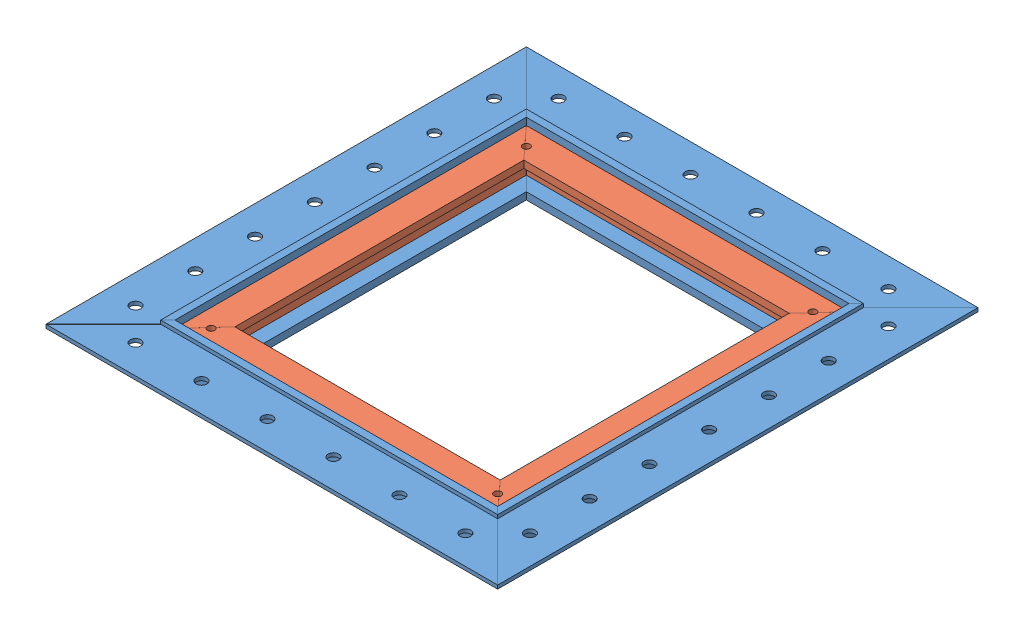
SolidWorks assembly 611 - Copy.SLDASM, configuration Default (file format 11000). Lengths in mm.
Overall size (200.03 22.23 212.72).
16 component instances, 5 part files, 32 mates.
Components (placement in the parent):
- J-Frame AG10 Grille(For aluminium)-2: J-Frame AG10 Grille(For aluminium).SLDPRT [Default] at origin size (200.03 22.23 212.72)
- 208 Lattice Perforated Grille(3_8)-1: 208 Lattice Perforated Grille(3_8).SLDPRT [Default] at (61.9125 22.225 0) x (0 0 -1) z (0 -1 0) (suppressed, hidden)
- Screw-1: Screw.SLDPRT [Default] at (125.349 19.05 -69.7865) x (0 1 0) z (1 0 0) (suppressed, hidden)
- Screw-2: Screw.SLDPRT [Default] at (-1.524 19.05 -69.7865) x (0 1 0) z (1 0 0) (suppressed, hidden)
- Screw-3: Screw.SLDPRT [Default] at (125.349 19.05 69.7865) x (0 1 0) z (-1 0 0) (suppressed, hidden)
- Screw-4: Screw.SLDPRT [Default] at (-1.524 19.05 69.7865) x (0 1 0) z (-1 0 0) (suppressed, hidden)
- Typical Dry Wall Screw-1: Typical Dry Wall Screw.SLDPRT [Default] at (-25.4 20.6375 -79.375) (suppressed, hidden)
- Typical Dry Wall Screw-2: Typical Dry Wall Screw.SLDPRT [Default] at (-25.4 20.6375 52.9167) (suppressed, hidden)
- Typical Dry Wall Screw-3: Typical Dry Wall Screw.SLDPRT [Default] at (-11.1125 20.6375 93.6625) (suppressed, hidden)
- Typical Dry Wall Screw-4: Typical Dry Wall Screw.SLDPRT [Default] at (105.7275 20.6375 93.6625) (suppressed, hidden)
- Typical Dry Wall Screw-5: Typical Dry Wall Screw.SLDPRT [Default] at (149.225 20.6375 79.375) (suppressed, hidden)
- Typical Dry Wall Screw-6: Typical Dry Wall Screw.SLDPRT [Default] at (149.225 20.6375 -52.9167) (suppressed, hidden)
- Typical Dry Wall Screw-7: Typical Dry Wall Screw.SLDPRT [Default] at (134.9375 20.6375 -93.6625) (suppressed, hidden)
- Typical Dry Wall Screw-8: Typical Dry Wall Screw.SLDPRT [Default] at (18.0975 20.6375 -93.6625) (suppressed, hidden)
- Angle-1: Angle.SLDPRT [Default] at (61.9125 19.05 0) size (142.88 15.88 155.57)
- Angle-2: Angle.SLDPRT [Default] at (61.9125 19.05 0) x (-1 0 0) z (0 0 -1) size (142.88 15.88 155.57) (suppressed, hidden)
Mates (geometry in assembly coordinates):
- Coincident1: coincident: plane of assembly; plane of assembly; plane of J-Frame AG10 Grille(For aluminium)-2 through (0 22.225 77.7875) normal (0 1 0); plane of 208 Lattice Perforated Grille(3_8)-1 through (61.9125 22.225 0) normal (0 1 0)
- Distance1: distance = 1.5875 mm: plane of assembly; plane of assembly; plane of 208 Lattice Perforated Grille(3_8)-1 through (131.7625 19.05 -76.2) normal (0 0 -1); plane of J-Frame AG10 Grille(For aluminium)-2 through (-38.1 0 -77.7875) normal (0 0 1)
- Distance2: distance = 1.5875 mm: plane of assembly; plane of assembly; plane of 208 Lattice Perforated Grille(3_8)-1 through (131.7625 19.05 76.2) normal (1 0 0); plane of J-Frame AG10 Grille(For aluminium)-2 through (133.35 0 77.7875) normal (-1 0 0)
- Concentric1: concentric: cone of assembly; cylinder of assembly; cone of 208 Lattice Perforated Grille(3_8)-1 through (125.349 22.225 -69.7865) axis (0 -1 0); cylinder of Screw-1 through (125.349 22.225 -69.7865) axis (0 1 0) radius 1.59
- Coincident4: coincident: plane of assembly; plane of assembly; plane of 208 Lattice Perforated Grille(3_8)-1 through (61.9125 22.225 0) normal (0 1 0); plane of Screw-1 through (125.349 22.225 -69.7865) normal (0 1 0)
- Parallel1: parallel: plane of assembly; plane of assembly; plane of 208 Lattice Perforated Grille(3_8)-1 through (131.7625 19.05 -76.2) normal (0 0 -1); plane of Screw-1 through (125.0112 21.5697 -69.4487) normal (0 0 -1)
- Concentric2: concentric: cylinder of assembly; cylinder of assembly; cylinder of J-Frame AG10 Grille(For aluminium)-2 through (-25.4 18.0975 -79.375) axis (0 1 0) radius 2.3813; cylinder of Typical Dry Wall Screw-1 through (-25.4 20.6375 -79.375) axis (0 1 0) radius 3.81
- Coincident6: coincident: plane of assembly; circle of assembly; plane of J-Frame AG10 Grille(For aluminium)-2 through (0 20.6375 77.7875) normal (0 1 0); circle of Typical Dry Wall Screw-1
- Parallel2: parallel: plane of assembly; plane of assembly; plane of J-Frame AG10 Grille(For aluminium)-2 through (-38.1 0 0) normal (-1 0 0); plane of Typical Dry Wall Screw-1 through (-25.019 21.1455 -77.089) normal (-1 0 0)
- Coincident8: coincident: plane of assembly; circle of assembly; plane of J-Frame AG10 Grille(For aluminium)-2 through (0 20.6375 77.7875) normal (0 1 0); circle of Typical Dry Wall Screw-2
- Concentric3: concentric: cylinder of assembly; cylinder of assembly; cylinder of J-Frame AG10 Grille(For aluminium)-2 through (-25.4 18.0975 52.9167) axis (0 1 0) radius 2.3813; cylinder of Typical Dry Wall Screw-2 through (-25.4 20.6375 52.9167) axis (0 1 0) radius 3.81
- Parallel3: parallel: plane of assembly; plane of assembly; plane of J-Frame AG10 Grille(For aluminium)-2 through (-38.1 0 0) normal (-1 0 0); plane of Typical Dry Wall Screw-2 through (-25.019 21.1455 55.2027) normal (-1 0 0)
- Coincident10: coincident: plane of assembly; circle of assembly; plane of J-Frame AG10 Grille(For aluminium)-2 through (0 20.6375 77.7875) normal (0 1 0); circle of Typical Dry Wall Screw-3
- Concentric4: concentric: cylinder of assembly; cylinder of assembly; cylinder of J-Frame AG10 Grille(For aluminium)-2 through (-11.1125 18.0975 93.6625) axis (0 1 0) radius 2.3749; cylinder of Typical Dry Wall Screw-3 through (-11.1125 20.6375 93.6625) axis (0 1 0) radius 3.81
- Coincident12: coincident: plane of assembly; circle of assembly; plane of J-Frame AG10 Grille(For aluminium)-2 through (0 20.6375 77.7875) normal (0 1 0); circle of Typical Dry Wall Screw-4
- Concentric5: concentric: cylinder of assembly; cylinder of assembly; cylinder of J-Frame AG10 Grille(For aluminium)-2 through (105.7275 18.0975 93.6625) axis (0 1 0) radius 2.3749; cylinder of Typical Dry Wall Screw-4 through (105.7275 20.6375 93.6625) axis (0 1 0) radius 3.81
- Parallel5: parallel: plane of assembly; plane of assembly; plane of J-Frame AG10 Grille(For aluminium)-2 through (-38.1 0 106.3625) normal (0 0 1); plane of Typical Dry Wall Screw-4 through (105.3465 21.1455 95.9485) normal (0 0 -1)
- Coincident14: coincident: plane of assembly; circle of assembly; plane of J-Frame AG10 Grille(For aluminium)-2 through (0 20.6375 77.7875) normal (0 1 0); circle of Typical Dry Wall Screw-5
- Concentric6: concentric: cylinder of assembly; cylinder of assembly; cylinder of J-Frame AG10 Grille(For aluminium)-2 through (149.225 18.0975 79.375) axis (0 1 0) radius 2.3813; cylinder of Typical Dry Wall Screw-5 through (149.225 20.6375 79.375) axis (0 1 0) radius 3.81
- Parallel6: parallel: plane of assembly; plane of assembly; plane of J-Frame AG10 Grille(For aluminium)-2 through (161.925 0 77.7875) normal (1 0 0); plane of Typical Dry Wall Screw-5 through (148.844 21.1455 81.661) normal (1 0 0)
- Coincident16: coincident: plane of assembly; circle of assembly; plane of J-Frame AG10 Grille(For aluminium)-2 through (0 20.6375 77.7875) normal (0 1 0); circle of Typical Dry Wall Screw-6
- Concentric7: concentric: cylinder of J-Frame AG10 Grille(For aluminium)-2 through (149.225 18.0975 -52.9167) axis (0 1 0) radius 2.3813; cylinder of Typical Dry Wall Screw-6 through (149.225 20.6375 -52.9167) axis (0 1 0) radius 3.81
- Parallel7: parallel: plane of J-Frame AG10 Grille(For aluminium)-2 through (161.925 0 77.7875) normal (1 0 0); plane of Typical Dry Wall Screw-6 through (148.844 21.1455 -50.6307) normal (1 0 0)
- Coincident18: coincident: plane of assembly; circle of assembly; plane of J-Frame AG10 Grille(For aluminium)-2 through (0 20.6375 77.7875) normal (0 1 0); circle of Typical Dry Wall Screw-7
- Concentric9: concentric: cylinder of J-Frame AG10 Grille(For aluminium)-2 through (134.9375 18.0975 -93.6625) axis (0 1 0) radius 2.3749; cylinder of Typical Dry Wall Screw-7 through (134.9375 20.6375 -93.6625) axis (0 1 0) radius 3.81
- Parallel8: parallel: plane of J-Frame AG10 Grille(For aluminium)-2 through (-38.1 0 -106.3625) normal (0 0 -1); plane of Typical Dry Wall Screw-7 through (134.5565 21.1455 -93.2815) normal (0 0 -1)
- Coincident20: coincident: plane of assembly; circle of assembly; plane of J-Frame AG10 Grille(For aluminium)-2 through (0 20.6375 77.7875) normal (0 1 0); circle of Typical Dry Wall Screw-8
- Concentric10: concentric: cylinder of assembly; cylinder of assembly; cylinder of J-Frame AG10 Grille(For aluminium)-2 through (18.0975 18.0975 -93.6625) axis (0 1 0) radius 2.3749; cylinder of Typical Dry Wall Screw-8 through (18.0975 20.6375 -93.6625) axis (0 1 0) radius 3.81
- Parallel9: parallel: plane of assembly; plane of assembly; plane of J-Frame AG10 Grille(For aluminium)-2 through (-38.1 0 -106.3625) normal (0 0 -1); plane of Typical Dry Wall Screw-8 through (17.7165 21.1455 -93.2815) normal (0 0 -1)
- Coincident22: coincident: plane of assembly; plane of assembly; plane of J-Frame AG10 Grille(For aluminium)-2 through (-9.525 22.225 77.7875) normal (1 0 0); plane of Angle-1 through (-9.525 15.875 77.7875) normal (-1 0 0)
- Coincident23: coincident: plane of assembly; plane of assembly; plane of J-Frame AG10 Grille(For aluminium)-2 through (-38.1 0 77.7875) normal (0 0 -1); plane of Angle-1 through (133.35 15.875 77.7875) normal (0 0 1)
- Coincident24: coincident: plane of assembly; plane of assembly; plane of J-Frame AG10 Grille(For aluminium)-2 through (0 3.175 77.7875) normal (0 1 0); plane of Angle-1 through (61.9125 3.175 0) normal (0 -1 0)
